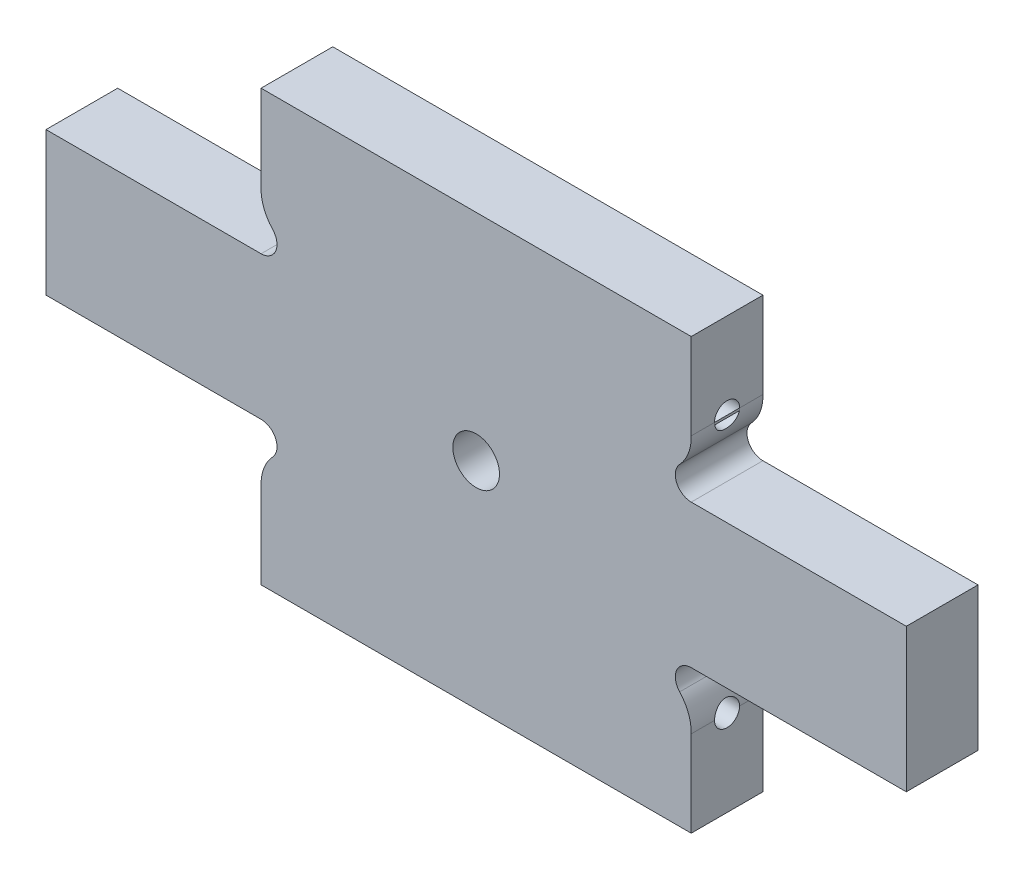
ISO-10303-21;
HEADER;
FILE_DESCRIPTION(('STEP AP214'),'2;1');
FILE_NAME('part.step','',(''),(''),'','','');
FILE_SCHEMA(('AUTOMOTIVE_DESIGN { 1 0 10303 214 1 1 1 1 }'));
ENDSEC;
DATA;
#1=APPLICATION_CONTEXT('core data for automotive mechanical design processes');
#2=APPLICATION_PROTOCOL_DEFINITION('international standard','automotive_design',2000,#1);
#3=PRODUCT_CONTEXT('',#1,'mechanical');
#4=PRODUCT('Part','Part','',(#3));
#5=PRODUCT_RELATED_PRODUCT_CATEGORY('part','',(#4));
#6=PRODUCT_DEFINITION_FORMATION('','',#4);
#7=PRODUCT_DEFINITION_CONTEXT('part definition',#1,'design');
#8=PRODUCT_DEFINITION('design','',#6,#7);
#9=PRODUCT_DEFINITION_SHAPE('','',#8);
#10=(LENGTH_UNIT() NAMED_UNIT(*) SI_UNIT(.MILLI.,.METRE.));
#11=(NAMED_UNIT(*) PLANE_ANGLE_UNIT() SI_UNIT($,.RADIAN.));
#12=(NAMED_UNIT(*) SI_UNIT($,.STERADIAN.) SOLID_ANGLE_UNIT());
#13=UNCERTAINTY_MEASURE_WITH_UNIT(LENGTH_MEASURE(1.E-05),#10,'distance_accuracy_value','');
#14=(GEOMETRIC_REPRESENTATION_CONTEXT(3) GLOBAL_UNCERTAINTY_ASSIGNED_CONTEXT((#13)) GLOBAL_UNIT_ASSIGNED_CONTEXT((#10,
#11,#12)) REPRESENTATION_CONTEXT('',''));
#15=CARTESIAN_POINT('',(0.,0.,0.));
#16=DIRECTION('',(0.,0.,1.));
#17=DIRECTION('',(1.,0.,0.));
#18=AXIS2_PLACEMENT_3D('',#15,#16,#17);
#19=CARTESIAN_POINT('',(24.0021116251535,17.8408301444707,10.));
#20=DIRECTION('',(0.,0.,-1.));
#21=DIRECTION('',(-1.,0.,0.));
#22=AXIS2_PLACEMENT_3D('',#19,#20,#21);
#23=CYLINDRICAL_SURFACE('',#22,6.00000000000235);
#24=CARTESIAN_POINT('',(30.,17.6816602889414,3.27919791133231));
#25=CARTESIAN_POINT('',(29.9987313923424,17.6337424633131,3.28806184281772));
#26=CARTESIAN_POINT('',(29.9968924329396,17.5862353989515,3.29892223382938));
#27=CARTESIAN_POINT('',(29.9921670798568,17.4923496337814,3.32454189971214));
#28=CARTESIAN_POINT('',(29.989280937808,17.4459706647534,3.33930023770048));
#29=CARTESIAN_POINT('',(29.9792095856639,17.3092146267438,3.38919308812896));
#30=CARTESIAN_POINT('',(29.9706030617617,17.2209391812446,3.42999758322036));
#31=CARTESIAN_POINT('',(29.9507233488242,17.0526542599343,3.52541371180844));
#32=CARTESIAN_POINT('',(29.9394511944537,16.9726415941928,3.58001998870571));
#33=CARTESIAN_POINT('',(29.9155983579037,16.8227748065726,3.70155930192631));
#34=CARTESIAN_POINT('',(29.9030172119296,16.7529243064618,3.76849671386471));
#35=CARTESIAN_POINT('',(29.8777467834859,16.6237217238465,3.91460477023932));
#36=CARTESIAN_POINT('',(29.8650614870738,16.5646427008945,3.99401777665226));
#37=CARTESIAN_POINT('',(29.8414450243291,16.4605977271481,4.16185492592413));
#38=CARTESIAN_POINT('',(29.8305138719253,16.4156318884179,4.2502791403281));
#39=CARTESIAN_POINT('',(29.8118198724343,16.3412405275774,4.43361922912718));
#40=CARTESIAN_POINT('',(29.8040524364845,16.3117924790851,4.52852546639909));
#41=CARTESIAN_POINT('',(29.7927035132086,16.2693540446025,4.72218092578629));
#42=CARTESIAN_POINT('',(29.7891208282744,16.256358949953,4.82092904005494));
#43=CARTESIAN_POINT('',(29.7866706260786,16.2474389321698,5.0160343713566));
#44=CARTESIAN_POINT('',(29.7876541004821,16.2509745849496,5.11236539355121));
#45=CARTESIAN_POINT('',(29.7938668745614,16.2737603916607,5.30300554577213));
#46=CARTESIAN_POINT('',(29.7990961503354,16.2930104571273,5.39731468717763));
#47=CARTESIAN_POINT('',(29.8130743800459,16.3463546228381,5.58050609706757));
#48=CARTESIAN_POINT('',(29.8217943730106,16.380326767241,5.6694262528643));
#49=CARTESIAN_POINT('',(29.8416979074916,16.4620650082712,5.84037847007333));
#50=CARTESIAN_POINT('',(29.852881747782,16.5098327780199,5.92240969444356));
#51=CARTESIAN_POINT('',(29.8767647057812,16.6194848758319,6.07988667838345));
#52=CARTESIAN_POINT('',(29.8894989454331,16.6817461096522,6.15506471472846));
#53=CARTESIAN_POINT('',(29.914681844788,16.8179421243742,6.2941067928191));
#54=CARTESIAN_POINT('',(29.9271303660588,16.8918824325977,6.3579654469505));
#55=CARTESIAN_POINT('',(29.9504593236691,17.0510508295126,6.47372665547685));
#56=CARTESIAN_POINT('',(29.9613048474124,17.1364692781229,6.52537458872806));
#57=CARTESIAN_POINT('',(29.9797000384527,17.3150510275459,6.61344855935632));
#58=CARTESIAN_POINT('',(29.9872558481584,17.4081995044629,6.64990295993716));
#59=CARTESIAN_POINT('',(29.9942830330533,17.5330112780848,6.68681922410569));
#60=CARTESIAN_POINT('',(29.9957265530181,17.5625013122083,6.69470639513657));
#61=CARTESIAN_POINT('',(29.9981864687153,17.6218268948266,6.70892101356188));
#62=CARTESIAN_POINT('',(29.9992034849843,17.6516618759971,6.7152507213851));
#63=CARTESIAN_POINT('',(30.,17.6816602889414,6.72080208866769));
#64=B_SPLINE_CURVE_WITH_KNOTS('',3,(#24,#25,#26,#27,#28,#29,#30,#31,#32,#33,#34,#35,#36,#37,#38,
#39,#40,#41,#42,#43,#44,#45,#46,#47,#48,#49,#50,#51,#52,#53,#54,#55,#56,#57,#58,#59,#60,#61,#62,
#63),.UNSPECIFIED.,.F.,.F.,(4,2,2,2,2,2,2,2,2,2,2,2,2,2,2,2,2,2,2,4),(0.,0.146146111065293,
0.292257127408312,0.583637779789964,0.874905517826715,1.16627680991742,1.4642356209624,
1.76219679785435,2.05972423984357,2.35716651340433,2.64497179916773,2.93277546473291,
3.21823925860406,3.50373768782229,3.79770983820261,4.09182153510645,4.39161125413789,
4.69083879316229,4.7824893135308,4.8740060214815),.UNSPECIFIED.);
#65=CARTESIAN_POINT('',(30.,17.6816602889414,3.27919791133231));
#66=VERTEX_POINT('',#65);
#67=CARTESIAN_POINT('',(30.,17.6816602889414,6.72080208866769));
#68=VERTEX_POINT('',#67);
#69=EDGE_CURVE('E498',#66,#68,#64,.T.);
#70=ORIENTED_EDGE('',*,*,#69,.T.);
#71=DIRECTION('',(0.,0.,-1.));
#72=VECTOR('',#71,1.);
#73=CARTESIAN_POINT('',(30.,17.6816602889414,10.));
#74=LINE('',#73,#72);
#75=EDGE_CURVE('E603',#68,#66,#74,.T.);
#76=ORIENTED_EDGE('',*,*,#75,.T.);
#77=EDGE_LOOP('',(#70,#76));
#78=FACE_BOUND('',#77,.T.);
#79=CARTESIAN_POINT('',(24.0021116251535,17.8408301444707,0.));
#80=DIRECTION('',(0.,0.,1.));
#81=DIRECTION('',(-1.,0.,0.));
#82=AXIS2_PLACEMENT_3D('',#79,#80,#81);
#83=CIRCLE('',#82,6.00000000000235);
#84=CARTESIAN_POINT('',(28.3795620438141,13.7374257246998,0.));
#85=VERTEX_POINT('',#84);
#86=CARTESIAN_POINT('',(30.,18.,0.));
#87=VERTEX_POINT('',#86);
#88=EDGE_CURVE('E274',#85,#87,#83,.T.);
#89=ORIENTED_EDGE('',*,*,#88,.T.);
#90=DIRECTION('',(0.,0.,-1.));
#91=VECTOR('',#90,1.);
#92=CARTESIAN_POINT('',(30.,18.,10.));
#93=LINE('',#92,#91);
#94=CARTESIAN_POINT('',(30.,18.,3.25000000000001));
#95=VERTEX_POINT('',#94);
#96=EDGE_CURVE('E482',#95,#87,#93,.T.);
#97=ORIENTED_EDGE('',*,*,#96,.F.);
#98=CARTESIAN_POINT('',(30.,18.,6.74999999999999));
#99=VERTEX_POINT('',#98);
#100=EDGE_CURVE('E488',#99,#95,#93,.T.);
#101=ORIENTED_EDGE('',*,*,#100,.F.);
#102=CARTESIAN_POINT('',(30.,18.,10.));
#103=VERTEX_POINT('',#102);
#104=EDGE_CURVE('E483',#103,#99,#93,.T.);
#105=ORIENTED_EDGE('',*,*,#104,.F.);
#106=CARTESIAN_POINT('',(24.0021116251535,17.8408301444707,10.));
#107=DIRECTION('',(0.,0.,1.));
#108=DIRECTION('',(-1.,0.,0.));
#109=AXIS2_PLACEMENT_3D('',#106,#107,#108);
#110=CIRCLE('',#109,6.00000000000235);
#111=CARTESIAN_POINT('',(28.3795620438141,13.7374257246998,10.));
#112=VERTEX_POINT('',#111);
#113=EDGE_CURVE('E278',#112,#103,#110,.T.);
#114=ORIENTED_EDGE('',*,*,#113,.F.);
#115=DIRECTION('',(0.,0.,-1.));
#116=VECTOR('',#115,1.);
#117=CARTESIAN_POINT('',(28.3795620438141,13.7374257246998,10.));
#118=LINE('',#117,#116);
#119=EDGE_CURVE('E340',#112,#85,#118,.T.);
#120=ORIENTED_EDGE('',*,*,#119,.T.);
#121=EDGE_LOOP('',(#89,#97,#101,#105,#114,#120));
#122=FACE_BOUND('',#121,.T.);
#123=ADVANCED_FACE('F45',(#78,#122),#23,.T.);
#124=CARTESIAN_POINT('',(30.,30.,10.));
#125=DIRECTION('',(-1.,0.,0.));
#126=DIRECTION('',(0.,-1.,0.));
#127=AXIS2_PLACEMENT_3D('',#124,#125,#126);
#128=PLANE('',#127);
#129=ORIENTED_EDGE('',*,*,#104,.T.);
#130=CARTESIAN_POINT('',(30.,18.,5.));
#131=DIRECTION('',(1.,0.,0.));
#132=DIRECTION('',(0.,0.,-1.));
#133=AXIS2_PLACEMENT_3D('',#130,#131,#132);
#134=CIRCLE('',#133,1.74999999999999);
#135=EDGE_CURVE('E252',#95,#99,#134,.T.);
#136=ORIENTED_EDGE('',*,*,#135,.F.);
#137=ORIENTED_EDGE('',*,*,#96,.T.);
#138=DIRECTION('',(0.,1.,0.));
#139=VECTOR('',#138,1.);
#140=CARTESIAN_POINT('',(30.,30.,0.));
#141=LINE('',#140,#139);
#142=CARTESIAN_POINT('',(30.,30.,0.));
#143=VERTEX_POINT('',#142);
#144=EDGE_CURVE('E344',#87,#143,#141,.T.);
#145=ORIENTED_EDGE('',*,*,#144,.T.);
#146=DIRECTION('',(0.,0.,-1.));
#147=VECTOR('',#146,1.);
#148=CARTESIAN_POINT('',(30.,30.,10.));
#149=LINE('',#148,#147);
#150=CARTESIAN_POINT('',(30.,30.,10.));
#151=VERTEX_POINT('',#150);
#152=EDGE_CURVE('E478',#151,#143,#149,.T.);
#153=ORIENTED_EDGE('',*,*,#152,.F.);
#154=DIRECTION('',(0.,1.,0.));
#155=VECTOR('',#154,1.);
#156=CARTESIAN_POINT('',(30.,30.,10.));
#157=LINE('',#156,#155);
#158=EDGE_CURVE('E282',#103,#151,#157,.T.);
#159=ORIENTED_EDGE('',*,*,#158,.F.);
#160=EDGE_LOOP('',(#129,#136,#137,#145,#153,#159));
#161=FACE_BOUND('',#160,.T.);
#162=ADVANCED_FACE('F558',(#161),#128,.F.);
#163=CARTESIAN_POINT('',(30.,30.,10.));
#164=DIRECTION('',(0.,-1.,0.));
#165=DIRECTION('',(1.,0.,0.));
#166=AXIS2_PLACEMENT_3D('',#163,#164,#165);
#167=PLANE('',#166);
#168=DIRECTION('',(-1.,0.,0.));
#169=VECTOR('',#168,1.);
#170=CARTESIAN_POINT('',(30.,30.,0.));
#171=LINE('',#170,#169);
#172=CARTESIAN_POINT('',(-30.,30.,0.));
#173=VERTEX_POINT('',#172);
#174=EDGE_CURVE('E347',#143,#173,#171,.T.);
#175=ORIENTED_EDGE('',*,*,#174,.T.);
#176=DIRECTION('',(0.,0.,-1.));
#177=VECTOR('',#176,1.);
#178=CARTESIAN_POINT('',(-30.,30.,10.));
#179=LINE('',#178,#177);
#180=CARTESIAN_POINT('',(-30.,30.,10.));
#181=VERTEX_POINT('',#180);
#182=EDGE_CURVE('E473',#181,#173,#179,.T.);
#183=ORIENTED_EDGE('',*,*,#182,.F.);
#184=DIRECTION('',(-1.,0.,0.));
#185=VECTOR('',#184,1.);
#186=CARTESIAN_POINT('',(30.,30.,10.));
#187=LINE('',#186,#185);
#188=EDGE_CURVE('E286',#151,#181,#187,.T.);
#189=ORIENTED_EDGE('',*,*,#188,.F.);
#190=ORIENTED_EDGE('',*,*,#152,.T.);
#191=EDGE_LOOP('',(#175,#183,#189,#190));
#192=FACE_BOUND('',#191,.T.);
#193=ADVANCED_FACE('F563',(#192),#167,.F.);
#194=CARTESIAN_POINT('',(-30.,30.,10.));
#195=DIRECTION('',(1.,0.,0.));
#196=DIRECTION('',(0.,1.,0.));
#197=AXIS2_PLACEMENT_3D('',#194,#195,#196);
#198=PLANE('',#197);
#199=DIRECTION('',(0.,0.,-1.));
#200=VECTOR('',#199,1.);
#201=CARTESIAN_POINT('',(-30.,18.,10.));
#202=LINE('',#201,#200);
#203=CARTESIAN_POINT('',(-30.,18.,3.25000000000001));
#204=VERTEX_POINT('',#203);
#205=CARTESIAN_POINT('',(-30.,18.,0.));
#206=VERTEX_POINT('',#205);
#207=EDGE_CURVE('E468',#204,#206,#202,.T.);
#208=ORIENTED_EDGE('',*,*,#207,.F.);
#209=CARTESIAN_POINT('',(-30.,18.,5.));
#210=DIRECTION('',(-1.,0.,0.));
#211=DIRECTION('',(0.,0.,1.));
#212=AXIS2_PLACEMENT_3D('',#209,#210,#211);
#213=CIRCLE('',#212,1.74999999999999);
#214=CARTESIAN_POINT('',(-30.,18.,6.74999999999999));
#215=VERTEX_POINT('',#214);
#216=EDGE_CURVE('E239',#215,#204,#213,.T.);
#217=ORIENTED_EDGE('',*,*,#216,.F.);
#218=CARTESIAN_POINT('',(-30.,18.,10.));
#219=VERTEX_POINT('',#218);
#220=EDGE_CURVE('E469',#219,#215,#202,.T.);
#221=ORIENTED_EDGE('',*,*,#220,.F.);
#222=DIRECTION('',(0.,-1.,0.));
#223=VECTOR('',#222,1.);
#224=CARTESIAN_POINT('',(-30.,30.,10.));
#225=LINE('',#224,#223);
#226=EDGE_CURVE('E289',#181,#219,#225,.T.);
#227=ORIENTED_EDGE('',*,*,#226,.F.);
#228=ORIENTED_EDGE('',*,*,#182,.T.);
#229=DIRECTION('',(0.,-1.,0.));
#230=VECTOR('',#229,1.);
#231=CARTESIAN_POINT('',(-30.,30.,0.));
#232=LINE('',#231,#230);
#233=EDGE_CURVE('E350',#173,#206,#232,.T.);
#234=ORIENTED_EDGE('',*,*,#233,.T.);
#235=EDGE_LOOP('',(#208,#217,#221,#227,#228,#234));
#236=FACE_BOUND('',#235,.T.);
#237=ADVANCED_FACE('F654',(#236),#198,.F.);
#238=CARTESIAN_POINT('',(-24.0021116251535,17.8408301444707,10.));
#239=DIRECTION('',(0.,0.,-1.));
#240=DIRECTION('',(-1.,0.,0.));
#241=AXIS2_PLACEMENT_3D('',#238,#239,#240);
#242=CYLINDRICAL_SURFACE('',#241,6.00000000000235);
#243=CARTESIAN_POINT('',(-30.,17.6816602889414,6.72080208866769));
#244=CARTESIAN_POINT('',(-29.9987313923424,17.6337424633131,6.71193815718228));
#245=CARTESIAN_POINT('',(-29.9968924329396,17.5862353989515,6.70107776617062));
#246=CARTESIAN_POINT('',(-29.9921670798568,17.4923496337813,6.67545810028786));
#247=CARTESIAN_POINT('',(-29.989280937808,17.4459706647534,6.66069976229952));
#248=CARTESIAN_POINT('',(-29.9792095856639,17.3092146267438,6.61080691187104));
#249=CARTESIAN_POINT('',(-29.9706030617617,17.2209391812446,6.57000241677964));
#250=CARTESIAN_POINT('',(-29.9507233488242,17.0526542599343,6.47458628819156));
#251=CARTESIAN_POINT('',(-29.9394511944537,16.9726415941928,6.41998001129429));
#252=CARTESIAN_POINT('',(-29.9155983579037,16.8227748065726,6.29844069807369));
#253=CARTESIAN_POINT('',(-29.9030172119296,16.7529243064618,6.23150328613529));
#254=CARTESIAN_POINT('',(-29.8777467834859,16.6237217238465,6.08539522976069));
#255=CARTESIAN_POINT('',(-29.8650614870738,16.5646427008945,6.00598222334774));
#256=CARTESIAN_POINT('',(-29.8414450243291,16.4605977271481,5.83814507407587));
#257=CARTESIAN_POINT('',(-29.8305138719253,16.4156318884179,5.7497208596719));
#258=CARTESIAN_POINT('',(-29.8118198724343,16.3412405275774,5.56638077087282));
#259=CARTESIAN_POINT('',(-29.8040524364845,16.3117924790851,5.47147453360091));
#260=CARTESIAN_POINT('',(-29.7927035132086,16.2693540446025,5.27781907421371));
#261=CARTESIAN_POINT('',(-29.7891208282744,16.256358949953,5.17907095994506));
#262=CARTESIAN_POINT('',(-29.7866706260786,16.2474389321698,4.9839656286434));
#263=CARTESIAN_POINT('',(-29.7876541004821,16.2509745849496,4.88763460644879));
#264=CARTESIAN_POINT('',(-29.7938668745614,16.2737603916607,4.69699445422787));
#265=CARTESIAN_POINT('',(-29.7990961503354,16.2930104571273,4.60268531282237));
#266=CARTESIAN_POINT('',(-29.8130743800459,16.3463546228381,4.41949390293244));
#267=CARTESIAN_POINT('',(-29.8217943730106,16.380326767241,4.33057374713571));
#268=CARTESIAN_POINT('',(-29.8416979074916,16.4620650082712,4.15962152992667));
#269=CARTESIAN_POINT('',(-29.852881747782,16.5098327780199,4.07759030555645));
#270=CARTESIAN_POINT('',(-29.8767647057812,16.6194848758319,3.92011332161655));
#271=CARTESIAN_POINT('',(-29.8894989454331,16.6817461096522,3.84493528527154));
#272=CARTESIAN_POINT('',(-29.914681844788,16.8179421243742,3.7058932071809));
#273=CARTESIAN_POINT('',(-29.9271303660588,16.8918824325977,3.64203455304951));
#274=CARTESIAN_POINT('',(-29.9504593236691,17.0510508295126,3.52627334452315));
#275=CARTESIAN_POINT('',(-29.9613048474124,17.1364692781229,3.47462541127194));
#276=CARTESIAN_POINT('',(-29.9797000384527,17.3150510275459,3.38655144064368));
#277=CARTESIAN_POINT('',(-29.9872558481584,17.4081995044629,3.35009704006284));
#278=CARTESIAN_POINT('',(-29.9942830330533,17.5330112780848,3.31318077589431));
#279=CARTESIAN_POINT('',(-29.9957265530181,17.5625013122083,3.30529360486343));
#280=CARTESIAN_POINT('',(-29.9981864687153,17.6218268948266,3.29107898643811));
#281=CARTESIAN_POINT('',(-29.9992034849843,17.6516618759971,3.2847492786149));
#282=CARTESIAN_POINT('',(-30.,17.6816602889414,3.27919791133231));
#283=B_SPLINE_CURVE_WITH_KNOTS('',3,(#243,#244,#245,#246,#247,#248,#249,#250,#251,#252,#253,
#254,#255,#256,#257,#258,#259,#260,#261,#262,#263,#264,#265,#266,#267,#268,#269,#270,#271,#272,
#273,#274,#275,#276,#277,#278,#279,#280,#281,#282),.UNSPECIFIED.,.F.,.F.,(4,2,2,2,2,2,2,2,2,2,2,
2,2,2,2,2,2,2,2,4),(0.,0.146146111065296,0.292257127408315,0.583637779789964,0.874905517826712,
1.16627680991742,1.4642356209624,1.76219679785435,2.05972423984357,2.35716651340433,
2.64497179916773,2.93277546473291,3.21823925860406,3.50373768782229,3.79770983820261,
4.09182153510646,4.39161125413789,4.69083879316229,4.7824893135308,4.87400602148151),.UNSPECIFIED.);
#284=CARTESIAN_POINT('',(-30.,17.6816602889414,6.72080208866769));
#285=VERTEX_POINT('',#284);
#286=CARTESIAN_POINT('',(-30.,17.6816602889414,3.27919791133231));
#287=VERTEX_POINT('',#286);
#288=EDGE_CURVE('E54',#285,#287,#283,.T.);
#289=ORIENTED_EDGE('',*,*,#288,.T.);
#290=DIRECTION('',(0.,0.,-1.));
#291=VECTOR('',#290,1.);
#292=CARTESIAN_POINT('',(-30.,17.6816602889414,10.));
#293=LINE('',#292,#291);
#294=EDGE_CURVE('E11',#287,#285,#293,.F.);
#295=ORIENTED_EDGE('',*,*,#294,.T.);
#296=EDGE_LOOP('',(#289,#295));
#297=FACE_BOUND('',#296,.T.);
#298=CARTESIAN_POINT('',(-24.0021116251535,17.8408301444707,0.));
#299=DIRECTION('',(0.,0.,1.));
#300=DIRECTION('',(1.,0.,0.));
#301=AXIS2_PLACEMENT_3D('',#298,#299,#300);
#302=CIRCLE('',#301,6.00000000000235);
#303=CARTESIAN_POINT('',(-28.3795620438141,13.7374257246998,0.));
#304=VERTEX_POINT('',#303);
#305=EDGE_CURVE('E354',#206,#304,#302,.T.);
#306=ORIENTED_EDGE('',*,*,#305,.T.);
#307=DIRECTION('',(0.,0.,-1.));
#308=VECTOR('',#307,1.);
#309=CARTESIAN_POINT('',(-28.3795620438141,13.7374257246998,10.));
#310=LINE('',#309,#308);
#311=CARTESIAN_POINT('',(-28.3795620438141,13.7374257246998,10.));
#312=VERTEX_POINT('',#311);
#313=EDGE_CURVE('E464',#312,#304,#310,.T.);
#314=ORIENTED_EDGE('',*,*,#313,.F.);
#315=CARTESIAN_POINT('',(-24.0021116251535,17.8408301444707,10.));
#316=DIRECTION('',(0.,0.,1.));
#317=DIRECTION('',(1.,0.,0.));
#318=AXIS2_PLACEMENT_3D('',#315,#316,#317);
#319=CIRCLE('',#318,6.00000000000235);
#320=EDGE_CURVE('E292',#219,#312,#319,.T.);
#321=ORIENTED_EDGE('',*,*,#320,.F.);
#322=ORIENTED_EDGE('',*,*,#220,.T.);
#323=EDGE_CURVE('E474',#215,#204,#202,.T.);
#324=ORIENTED_EDGE('',*,*,#323,.T.);
#325=ORIENTED_EDGE('',*,*,#207,.T.);
#326=EDGE_LOOP('',(#306,#314,#321,#322,#324,#325));
#327=FACE_BOUND('',#326,.T.);
#328=ADVANCED_FACE('F658',(#297,#327),#242,.T.);
#329=CARTESIAN_POINT('',(-30.000000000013,12.2199999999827,10.));
#330=DIRECTION('',(0.,0.,-1.));
#331=DIRECTION('',(-1.,0.,0.));
#332=AXIS2_PLACEMENT_3D('',#329,#330,#331);
#333=CYLINDRICAL_SURFACE('',#332,2.21999999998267);
#334=CARTESIAN_POINT('',(-30.000000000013,12.2199999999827,0.));
#335=DIRECTION('',(0.,0.,-1.));
#336=DIRECTION('',(1.,0.,0.));
#337=AXIS2_PLACEMENT_3D('',#334,#335,#336);
#338=CIRCLE('',#337,2.21999999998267);
#339=CARTESIAN_POINT('',(-30.000000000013,10.,0.));
#340=VERTEX_POINT('',#339);
#341=EDGE_CURVE('E357',#304,#340,#338,.T.);
#342=ORIENTED_EDGE('',*,*,#341,.T.);
#343=DIRECTION('',(0.,0.,-1.));
#344=VECTOR('',#343,1.);
#345=CARTESIAN_POINT('',(-30.000000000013,10.,10.));
#346=LINE('',#345,#344);
#347=CARTESIAN_POINT('',(-30.000000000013,10.,10.));
#348=VERTEX_POINT('',#347);
#349=EDGE_CURVE('E460',#348,#340,#346,.T.);
#350=ORIENTED_EDGE('',*,*,#349,.F.);
#351=CARTESIAN_POINT('',(-30.000000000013,12.2199999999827,10.));
#352=DIRECTION('',(0.,0.,-1.));
#353=DIRECTION('',(1.,0.,0.));
#354=AXIS2_PLACEMENT_3D('',#351,#352,#353);
#355=CIRCLE('',#354,2.21999999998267);
#356=EDGE_CURVE('E295',#312,#348,#355,.T.);
#357=ORIENTED_EDGE('',*,*,#356,.F.);
#358=ORIENTED_EDGE('',*,*,#313,.T.);
#359=EDGE_LOOP('',(#342,#350,#357,#358));
#360=FACE_BOUND('',#359,.T.);
#361=ADVANCED_FACE('F668',(#360),#333,.F.);
#362=CARTESIAN_POINT('',(-30.000000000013,10.,10.));
#363=DIRECTION('',(0.,-1.,0.));
#364=DIRECTION('',(0.,0.,-1.));
#365=AXIS2_PLACEMENT_3D('',#362,#363,#364);
#366=PLANE('',#365);
#367=DIRECTION('',(-1.,0.,0.));
#368=VECTOR('',#367,1.);
#369=CARTESIAN_POINT('',(-30.000000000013,10.,0.));
#370=LINE('',#369,#368);
#371=CARTESIAN_POINT('',(-60.,10.,0.));
#372=VERTEX_POINT('',#371);
#373=EDGE_CURVE('E360',#340,#372,#370,.T.);
#374=ORIENTED_EDGE('',*,*,#373,.T.);
#375=DIRECTION('',(0.,0.,-1.));
#376=VECTOR('',#375,1.);
#377=CARTESIAN_POINT('',(-60.,10.,10.));
#378=LINE('',#377,#376);
#379=CARTESIAN_POINT('',(-60.,10.,10.));
#380=VERTEX_POINT('',#379);
#381=EDGE_CURVE('E456',#380,#372,#378,.T.);
#382=ORIENTED_EDGE('',*,*,#381,.F.);
#383=DIRECTION('',(-1.,0.,0.));
#384=VECTOR('',#383,1.);
#385=CARTESIAN_POINT('',(-30.000000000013,10.,10.));
#386=LINE('',#385,#384);
#387=EDGE_CURVE('E298',#348,#380,#386,.T.);
#388=ORIENTED_EDGE('',*,*,#387,.F.);
#389=ORIENTED_EDGE('',*,*,#349,.T.);
#390=EDGE_LOOP('',(#374,#382,#388,#389));
#391=FACE_BOUND('',#390,.T.);
#392=ADVANCED_FACE('F824',(#391),#366,.F.);
#393=CARTESIAN_POINT('',(-60.,10.,10.));
#394=DIRECTION('',(1.,0.,0.));
#395=DIRECTION('',(0.,0.,-1.));
#396=AXIS2_PLACEMENT_3D('',#393,#394,#395);
#397=PLANE('',#396);
#398=DIRECTION('',(0.,-1.,0.));
#399=VECTOR('',#398,1.);
#400=CARTESIAN_POINT('',(-60.,10.,0.));
#401=LINE('',#400,#399);
#402=CARTESIAN_POINT('',(-60.,-10.,0.));
#403=VERTEX_POINT('',#402);
#404=EDGE_CURVE('E363',#372,#403,#401,.T.);
#405=ORIENTED_EDGE('',*,*,#404,.T.);
#406=DIRECTION('',(0.,0.,-1.));
#407=VECTOR('',#406,1.);
#408=CARTESIAN_POINT('',(-60.,-10.,10.));
#409=LINE('',#408,#407);
#410=CARTESIAN_POINT('',(-60.,-10.,10.));
#411=VERTEX_POINT('',#410);
#412=EDGE_CURVE('E452',#411,#403,#409,.T.);
#413=ORIENTED_EDGE('',*,*,#412,.F.);
#414=DIRECTION('',(0.,-1.,0.));
#415=VECTOR('',#414,1.);
#416=CARTESIAN_POINT('',(-60.,10.,10.));
#417=LINE('',#416,#415);
#418=EDGE_CURVE('E301',#380,#411,#417,.T.);
#419=ORIENTED_EDGE('',*,*,#418,.F.);
#420=ORIENTED_EDGE('',*,*,#381,.T.);
#421=EDGE_LOOP('',(#405,#413,#419,#420));
#422=FACE_BOUND('',#421,.T.);
#423=ADVANCED_FACE('F815',(#422),#397,.F.);
#424=CARTESIAN_POINT('',(-60.,-10.,10.));
#425=DIRECTION('',(0.,1.,0.));
#426=DIRECTION('',(-1.,0.,0.));
#427=AXIS2_PLACEMENT_3D('',#424,#425,#426);
#428=PLANE('',#427);
#429=DIRECTION('',(1.,0.,0.));
#430=VECTOR('',#429,1.);
#431=CARTESIAN_POINT('',(-60.,-10.,0.));
#432=LINE('',#431,#430);
#433=CARTESIAN_POINT('',(-30.000000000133,-9.99999999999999,0.));
#434=VERTEX_POINT('',#433);
#435=EDGE_CURVE('E366',#403,#434,#432,.T.);
#436=ORIENTED_EDGE('',*,*,#435,.T.);
#437=DIRECTION('',(0.,0.,-1.));
#438=VECTOR('',#437,1.);
#439=CARTESIAN_POINT('',(-30.000000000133,-9.99999999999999,10.));
#440=LINE('',#439,#438);
#441=CARTESIAN_POINT('',(-30.000000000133,-9.99999999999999,10.));
#442=VERTEX_POINT('',#441);
#443=EDGE_CURVE('E448',#442,#434,#440,.T.);
#444=ORIENTED_EDGE('',*,*,#443,.F.);
#445=DIRECTION('',(1.,0.,0.));
#446=VECTOR('',#445,1.);
#447=CARTESIAN_POINT('',(-60.,-10.,10.));
#448=LINE('',#447,#446);
#449=EDGE_CURVE('E304',#411,#442,#448,.T.);
#450=ORIENTED_EDGE('',*,*,#449,.F.);
#451=ORIENTED_EDGE('',*,*,#412,.T.);
#452=EDGE_LOOP('',(#436,#444,#450,#451));
#453=FACE_BOUND('',#452,.T.);
#454=ADVANCED_FACE('F807',(#453),#428,.F.);
#455=CARTESIAN_POINT('',(-30.000000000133,-12.2200000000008,10.));
#456=DIRECTION('',(0.,0.,-1.));
#457=DIRECTION('',(-1.,0.,0.));
#458=AXIS2_PLACEMENT_3D('',#455,#456,#457);
#459=CYLINDRICAL_SURFACE('',#458,2.22000000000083);
#460=CARTESIAN_POINT('',(-30.000000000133,-12.2200000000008,0.));
#461=DIRECTION('',(0.,0.,-1.));
#462=DIRECTION('',(1.,0.,0.));
#463=AXIS2_PLACEMENT_3D('',#460,#461,#462);
#464=CIRCLE('',#463,2.22000000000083);
#465=CARTESIAN_POINT('',(-28.3795620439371,-13.7374257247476,0.));
#466=VERTEX_POINT('',#465);
#467=EDGE_CURVE('E369',#434,#466,#464,.T.);
#468=ORIENTED_EDGE('',*,*,#467,.T.);
#469=DIRECTION('',(0.,0.,-1.));
#470=VECTOR('',#469,1.);
#471=CARTESIAN_POINT('',(-28.3795620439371,-13.7374257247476,10.));
#472=LINE('',#471,#470);
#473=CARTESIAN_POINT('',(-28.3795620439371,-13.7374257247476,10.));
#474=VERTEX_POINT('',#473);
#475=EDGE_CURVE('E444',#474,#466,#472,.T.);
#476=ORIENTED_EDGE('',*,*,#475,.F.);
#477=CARTESIAN_POINT('',(-30.000000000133,-12.2200000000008,10.));
#478=DIRECTION('',(0.,0.,-1.));
#479=DIRECTION('',(1.,0.,0.));
#480=AXIS2_PLACEMENT_3D('',#477,#478,#479);
#481=CIRCLE('',#480,2.22000000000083);
#482=EDGE_CURVE('E307',#442,#474,#481,.T.);
#483=ORIENTED_EDGE('',*,*,#482,.F.);
#484=ORIENTED_EDGE('',*,*,#443,.T.);
#485=EDGE_LOOP('',(#468,#476,#483,#484));
#486=FACE_BOUND('',#485,.T.);
#487=ADVANCED_FACE('F678',(#486),#459,.F.);
#488=CARTESIAN_POINT('',(-24.0000000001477,-17.8385763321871,10.));
#489=DIRECTION('',(0.,0.,-1.));
#490=DIRECTION('',(-1.,0.,0.));
#491=AXIS2_PLACEMENT_3D('',#488,#489,#490);
#492=CYLINDRICAL_SURFACE('',#491,6.00000000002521);
#493=DIRECTION('',(0.,0.,-1.));
#494=VECTOR('',#493,1.);
#495=CARTESIAN_POINT('',(-29.9978281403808,-18.,10.));
#496=LINE('',#495,#494);
#497=CARTESIAN_POINT('',(-29.9978281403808,-18.,3.25000000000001));
#498=VERTEX_POINT('',#497);
#499=CARTESIAN_POINT('',(-29.9978281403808,-18.,0.));
#500=VERTEX_POINT('',#499);
#501=EDGE_CURVE('E439',#498,#500,#496,.T.);
#502=ORIENTED_EDGE('',*,*,#501,.F.);
#503=CARTESIAN_POINT('',(-29.9978281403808,-18.,3.25000000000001));
#504=CARTESIAN_POINT('',(-29.9991213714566,-17.9520643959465,3.2499992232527));
#505=CARTESIAN_POINT('',(-29.9998323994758,-17.9041364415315,3.25197087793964));
#506=CARTESIAN_POINT('',(-30.000114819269,-17.8086077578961,3.25983702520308));
#507=CARTESIAN_POINT('',(-29.9996863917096,-17.7610069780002,3.26573089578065));
#508=CARTESIAN_POINT('',(-29.9967354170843,-17.6194289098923,3.28921586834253));
#509=CARTESIAN_POINT('',(-29.9925547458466,-17.5263796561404,3.31261066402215));
#510=CARTESIAN_POINT('',(-29.9804039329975,-17.3456267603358,3.37413859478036));
#511=CARTESIAN_POINT('',(-29.9724339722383,-17.2579228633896,3.41227102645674));
#512=CARTESIAN_POINT('',(-29.9537286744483,-17.0900779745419,3.50213360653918));
#513=CARTESIAN_POINT('',(-29.9429925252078,-17.0099392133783,3.55386774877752));
#514=CARTESIAN_POINT('',(-29.9197837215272,-16.8576436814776,3.67074012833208));
#515=CARTESIAN_POINT('',(-29.9072790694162,-16.7856922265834,3.73613935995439));
#516=CARTESIAN_POINT('',(-29.8822022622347,-16.6535752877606,3.87793332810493));
#517=CARTESIAN_POINT('',(-29.8696300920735,-16.5934125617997,3.95433063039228));
#518=CARTESIAN_POINT('',(-29.8456500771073,-16.4852381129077,4.11804831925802));
#519=CARTESIAN_POINT('',(-29.8342754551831,-16.4375359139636,4.20557863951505));
#520=CARTESIAN_POINT('',(-29.8144966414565,-16.3575847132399,4.38774150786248));
#521=CARTESIAN_POINT('',(-29.8060918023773,-16.3253323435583,4.48237250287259));
#522=CARTESIAN_POINT('',(-29.7935011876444,-16.2778257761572,4.67414129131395));
#523=CARTESIAN_POINT('',(-29.7892371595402,-16.2622557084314,4.77119552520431));
#524=CARTESIAN_POINT('',(-29.7852212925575,-16.2475776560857,4.96662732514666));
#525=CARTESIAN_POINT('',(-29.7854686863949,-16.2484668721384,5.0650046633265));
#526=CARTESIAN_POINT('',(-29.7903669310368,-16.266403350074,5.25729660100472));
#527=CARTESIAN_POINT('',(-29.7948912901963,-16.2829864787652,5.35125827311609));
#528=CARTESIAN_POINT('',(-29.8075880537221,-16.3310838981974,5.53501515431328));
#529=CARTESIAN_POINT('',(-29.8157607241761,-16.3625992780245,5.6248100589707));
#530=CARTESIAN_POINT('',(-29.8348616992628,-16.4400104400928,5.79881083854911));
#531=CARTESIAN_POINT('',(-29.8458186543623,-16.48605702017,5.88294633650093));
#532=CARTESIAN_POINT('',(-29.8691380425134,-16.5911361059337,6.04246270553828));
#533=CARTESIAN_POINT('',(-29.8815007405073,-16.6501710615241,6.11784192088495));
#534=CARTESIAN_POINT('',(-29.9065961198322,-16.7818142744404,6.26024764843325));
#535=CARTESIAN_POINT('',(-29.919327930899,-16.8547975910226,6.32692811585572));
#536=CARTESIAN_POINT('',(-29.943195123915,-17.0111270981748,6.44718842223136));
#537=CARTESIAN_POINT('',(-29.9543301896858,-17.0944753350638,6.50076566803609));
#538=CARTESIAN_POINT('',(-29.973589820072,-17.2693897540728,6.59327094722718));
#539=CARTESIAN_POINT('',(-29.9817108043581,-17.3609655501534,6.63218155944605));
#540=CARTESIAN_POINT('',(-29.9937773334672,-17.5495816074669,6.69394119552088));
#541=CARTESIAN_POINT('',(-29.997728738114,-17.6466139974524,6.71681274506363));
#542=CARTESIAN_POINT('',(-29.9999295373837,-17.7870780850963,6.7375270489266));
#543=CARTESIAN_POINT('',(-30.0001445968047,-17.8295681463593,6.74220582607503));
#544=CARTESIAN_POINT('',(-29.9996677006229,-17.914702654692,6.74843918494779));
#545=CARTESIAN_POINT('',(-29.9989772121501,-17.9573467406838,6.74999880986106));
#546=CARTESIAN_POINT('',(-29.9978281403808,-18.,6.75000000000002));
#547=B_SPLINE_CURVE_WITH_KNOTS('',3,(#503,#504,#505,#506,#507,#508,#509,#510,#511,#512,#513,
#514,#515,#516,#517,#518,#519,#520,#521,#522,#523,#524,#525,#526,#527,#528,#529,#530,#531,#532,
#533,#534,#535,#536,#537,#538,#539,#540,#541,#542,#543,#544,#545,#546),.UNSPECIFIED.,.F.,.F.,(4,
2,2,2,2,2,2,2,2,2,2,2,2,2,2,2,2,2,2,2,2,4),(0.,0.143768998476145,0.28751520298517,
0.574130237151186,0.860731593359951,1.14741719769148,1.44018255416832,1.73301632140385,
2.03255040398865,2.33201916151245,2.62571161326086,2.91935411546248,3.20457514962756,
3.48981698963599,3.77812206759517,4.06648157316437,4.36410291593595,4.66178311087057,
4.95981578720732,5.25742905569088,5.38556886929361,5.51350133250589),.UNSPECIFIED.);
#548=CARTESIAN_POINT('',(-29.9978281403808,-18.,6.74999999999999));
#549=VERTEX_POINT('',#548);
#550=EDGE_CURVE('E605',#498,#549,#547,.T.);
#551=ORIENTED_EDGE('',*,*,#550,.T.);
#552=CARTESIAN_POINT('',(-29.9978281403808,-18.,10.));
#553=VERTEX_POINT('',#552);
#554=EDGE_CURVE('E440',#553,#549,#496,.T.);
#555=ORIENTED_EDGE('',*,*,#554,.F.);
#556=CARTESIAN_POINT('',(-24.0000000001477,-17.8385763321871,10.));
#557=DIRECTION('',(0.,0.,1.));
#558=DIRECTION('',(1.,0.,0.));
#559=AXIS2_PLACEMENT_3D('',#556,#557,#558);
#560=CIRCLE('',#559,6.00000000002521);
#561=EDGE_CURVE('E310',#474,#553,#560,.T.);
#562=ORIENTED_EDGE('',*,*,#561,.F.);
#563=ORIENTED_EDGE('',*,*,#475,.T.);
#564=CARTESIAN_POINT('',(-24.0000000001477,-17.8385763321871,0.));
#565=DIRECTION('',(0.,0.,1.));
#566=DIRECTION('',(1.,0.,0.));
#567=AXIS2_PLACEMENT_3D('',#564,#565,#566);
#568=CIRCLE('',#567,6.00000000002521);
#569=EDGE_CURVE('E372',#466,#500,#568,.T.);
#570=ORIENTED_EDGE('',*,*,#569,.T.);
#571=EDGE_LOOP('',(#502,#551,#555,#562,#563,#570));
#572=FACE_BOUND('',#571,.T.);
#573=ADVANCED_FACE('F622',(#572),#492,.T.);
#574=CARTESIAN_POINT('',(-29.9978281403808,-18.,10.));
#575=DIRECTION('',(1.,0.,0.));
#576=DIRECTION('',(0.,0.,-1.));
#577=AXIS2_PLACEMENT_3D('',#574,#575,#576);
#578=PLANE('',#577);
#579=ORIENTED_EDGE('',*,*,#554,.T.);
#580=CARTESIAN_POINT('',(-29.9978281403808,-18.,5.));
#581=DIRECTION('',(1.,0.,0.));
#582=DIRECTION('',(0.,0.,-1.));
#583=AXIS2_PLACEMENT_3D('',#580,#581,#582);
#584=CIRCLE('',#583,1.74999999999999);
#585=EDGE_CURVE('E244',#549,#498,#584,.T.);
#586=ORIENTED_EDGE('',*,*,#585,.T.);
#587=ORIENTED_EDGE('',*,*,#501,.T.);
#588=DIRECTION('',(0.,-1.,0.));
#589=VECTOR('',#588,1.);
#590=CARTESIAN_POINT('',(-29.9978281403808,-18.,0.));
#591=LINE('',#590,#589);
#592=CARTESIAN_POINT('',(-29.9978281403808,-30.,0.));
#593=VERTEX_POINT('',#592);
#594=EDGE_CURVE('E376',#500,#593,#591,.T.);
#595=ORIENTED_EDGE('',*,*,#594,.T.);
#596=DIRECTION('',(0.,0.,-1.));
#597=VECTOR('',#596,1.);
#598=CARTESIAN_POINT('',(-29.9978281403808,-30.,10.));
#599=LINE('',#598,#597);
#600=CARTESIAN_POINT('',(-29.9978281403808,-30.,10.));
#601=VERTEX_POINT('',#600);
#602=EDGE_CURVE('E435',#601,#593,#599,.T.);
#603=ORIENTED_EDGE('',*,*,#602,.F.);
#604=DIRECTION('',(0.,-1.,0.));
#605=VECTOR('',#604,1.);
#606=CARTESIAN_POINT('',(-29.9978281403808,-18.,10.));
#607=LINE('',#606,#605);
#608=EDGE_CURVE('E313',#553,#601,#607,.T.);
#609=ORIENTED_EDGE('',*,*,#608,.F.);
#610=EDGE_LOOP('',(#579,#586,#587,#595,#603,#609));
#611=FACE_BOUND('',#610,.T.);
#612=ADVANCED_FACE('F677',(#611),#578,.F.);
#613=CARTESIAN_POINT('',(-29.9978281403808,-30.,10.));
#614=DIRECTION('',(0.,1.,0.));
#615=DIRECTION('',(-1.,0.,0.));
#616=AXIS2_PLACEMENT_3D('',#613,#614,#615);
#617=PLANE('',#616);
#618=DIRECTION('',(1.,0.,0.));
#619=VECTOR('',#618,1.);
#620=CARTESIAN_POINT('',(-29.9978281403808,-30.,0.));
#621=LINE('',#620,#619);
#622=CARTESIAN_POINT('',(29.9978281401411,-30.,0.));
#623=VERTEX_POINT('',#622);
#624=EDGE_CURVE('E379',#593,#623,#621,.T.);
#625=ORIENTED_EDGE('',*,*,#624,.T.);
#626=DIRECTION('',(0.,0.,-1.));
#627=VECTOR('',#626,1.);
#628=CARTESIAN_POINT('',(29.9978281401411,-30.,10.));
#629=LINE('',#628,#627);
#630=CARTESIAN_POINT('',(29.9978281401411,-30.,10.));
#631=VERTEX_POINT('',#630);
#632=EDGE_CURVE('E431',#631,#623,#629,.T.);
#633=ORIENTED_EDGE('',*,*,#632,.F.);
#634=DIRECTION('',(1.,0.,0.));
#635=VECTOR('',#634,1.);
#636=CARTESIAN_POINT('',(-29.9978281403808,-30.,10.));
#637=LINE('',#636,#635);
#638=EDGE_CURVE('E316',#601,#631,#637,.T.);
#639=ORIENTED_EDGE('',*,*,#638,.F.);
#640=ORIENTED_EDGE('',*,*,#602,.T.);
#641=EDGE_LOOP('',(#625,#633,#639,#640));
#642=FACE_BOUND('',#641,.T.);
#643=ADVANCED_FACE('F686',(#642),#617,.F.);
#644=CARTESIAN_POINT('',(29.9978281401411,-30.,10.));
#645=DIRECTION('',(-1.,0.,0.));
#646=DIRECTION('',(0.,0.,1.));
#647=AXIS2_PLACEMENT_3D('',#644,#645,#646);
#648=PLANE('',#647);
#649=DIRECTION('',(0.,0.,-1.));
#650=VECTOR('',#649,1.);
#651=CARTESIAN_POINT('',(29.9978281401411,-18.,10.));
#652=LINE('',#651,#650);
#653=CARTESIAN_POINT('',(29.9978281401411,-18.,3.25000000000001));
#654=VERTEX_POINT('',#653);
#655=CARTESIAN_POINT('',(29.9978281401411,-18.,0.));
#656=VERTEX_POINT('',#655);
#657=EDGE_CURVE('E426',#654,#656,#652,.T.);
#658=ORIENTED_EDGE('',*,*,#657,.F.);
#659=CARTESIAN_POINT('',(29.9978281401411,-18.,5.));
#660=DIRECTION('',(-1.,0.,0.));
#661=DIRECTION('',(0.,0.,1.));
#662=AXIS2_PLACEMENT_3D('',#659,#660,#661);
#663=CIRCLE('',#662,1.74999999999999);
#664=CARTESIAN_POINT('',(29.9978281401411,-18.,6.74999999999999));
#665=VERTEX_POINT('',#664);
#666=EDGE_CURVE('E265',#654,#665,#663,.T.);
#667=ORIENTED_EDGE('',*,*,#666,.T.);
#668=CARTESIAN_POINT('',(29.9978281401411,-18.,10.));
#669=VERTEX_POINT('',#668);
#670=EDGE_CURVE('E427',#669,#665,#652,.T.);
#671=ORIENTED_EDGE('',*,*,#670,.F.);
#672=DIRECTION('',(0.,1.,0.));
#673=VECTOR('',#672,1.);
#674=CARTESIAN_POINT('',(29.9978281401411,-30.,10.));
#675=LINE('',#674,#673);
#676=EDGE_CURVE('E319',#631,#669,#675,.T.);
#677=ORIENTED_EDGE('',*,*,#676,.F.);
#678=ORIENTED_EDGE('',*,*,#632,.T.);
#679=DIRECTION('',(0.,1.,0.));
#680=VECTOR('',#679,1.);
#681=CARTESIAN_POINT('',(29.9978281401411,-30.,0.));
#682=LINE('',#681,#680);
#683=EDGE_CURVE('E382',#623,#656,#682,.T.);
#684=ORIENTED_EDGE('',*,*,#683,.T.);
#685=EDGE_LOOP('',(#658,#667,#671,#677,#678,#684));
#686=FACE_BOUND('',#685,.T.);
#687=ADVANCED_FACE('F555',(#686),#648,.F.);
#688=CARTESIAN_POINT('',(23.9999999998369,-17.8385763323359,10.));
#689=DIRECTION('',(0.,0.,-1.));
#690=DIRECTION('',(-1.,0.,0.));
#691=AXIS2_PLACEMENT_3D('',#688,#689,#690);
#692=CYLINDRICAL_SURFACE('',#691,6.00000000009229);
#693=ORIENTED_EDGE('',*,*,#670,.T.);
#694=CARTESIAN_POINT('',(29.9978281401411,-18.,6.74999999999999));
#695=CARTESIAN_POINT('',(29.9991213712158,-17.9520643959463,6.7500007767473));
#696=CARTESIAN_POINT('',(29.9998323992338,-17.9041364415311,6.74802912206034));
#697=CARTESIAN_POINT('',(30.0001148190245,-17.8086077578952,6.74016297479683));
#698=CARTESIAN_POINT('',(29.999686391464,-17.7610069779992,6.73426910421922));
#699=CARTESIAN_POINT('',(29.9967354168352,-17.6194289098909,6.71078413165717));
#700=CARTESIAN_POINT('',(29.9925547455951,-17.5263796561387,6.68738933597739));
#701=CARTESIAN_POINT('',(29.9804039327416,-17.3456267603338,6.62586140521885));
#702=CARTESIAN_POINT('',(29.9724339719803,-17.2579228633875,6.58772897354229));
#703=CARTESIAN_POINT('',(29.9537286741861,-17.0900779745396,6.49786639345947));
#704=CARTESIAN_POINT('',(29.9429925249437,-17.0099392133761,6.44613225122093));
#705=CARTESIAN_POINT('',(29.9197837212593,-16.8576436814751,6.32925987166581));
#706=CARTESIAN_POINT('',(29.9072790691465,-16.7856922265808,6.2638606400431));
#707=CARTESIAN_POINT('',(29.8822022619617,-16.6535752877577,6.12206667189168));
#708=CARTESIAN_POINT('',(29.8696300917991,-16.5934125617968,6.04566936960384));
#709=CARTESIAN_POINT('',(29.8456500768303,-16.4852381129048,5.88195168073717));
#710=CARTESIAN_POINT('',(29.8342754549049,-16.4375359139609,5.79442136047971));
#711=CARTESIAN_POINT('',(29.8144966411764,-16.3575847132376,5.61225849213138));
#712=CARTESIAN_POINT('',(29.8060918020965,-16.3253323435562,5.5176274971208));
#713=CARTESIAN_POINT('',(29.7935011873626,-16.2778257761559,5.32585870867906));
#714=CARTESIAN_POINT('',(29.7892371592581,-16.2622557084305,5.22880447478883));
#715=CARTESIAN_POINT('',(29.7852212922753,-16.2475776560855,5.03337267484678));
#716=CARTESIAN_POINT('',(29.7854686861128,-16.2484668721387,4.93499533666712));
#717=CARTESIAN_POINT('',(29.7903669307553,-16.2664033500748,4.74270339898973));
#718=CARTESIAN_POINT('',(29.7948912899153,-16.2829864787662,4.64874172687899));
#719=CARTESIAN_POINT('',(29.8075880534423,-16.3310838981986,4.4649848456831));
#720=CARTESIAN_POINT('',(29.815760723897,-16.3625992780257,4.37518994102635));
#721=CARTESIAN_POINT('',(29.8348616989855,-16.4400104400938,4.20118916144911));
#722=CARTESIAN_POINT('',(29.8458186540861,-16.4860570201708,4.1170536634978));
#723=CARTESIAN_POINT('',(29.8691380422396,-16.5911361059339,3.95753729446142));
#724=CARTESIAN_POINT('',(29.8815007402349,-16.6501710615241,3.88215807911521));
#725=CARTESIAN_POINT('',(29.9065961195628,-16.7818142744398,3.73975235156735));
#726=CARTESIAN_POINT('',(29.9193279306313,-16.8547975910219,3.67307188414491));
#727=CARTESIAN_POINT('',(29.943195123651,-17.0111270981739,3.55281157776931));
#728=CARTESIAN_POINT('',(29.9543301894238,-17.0944753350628,3.49923433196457));
#729=CARTESIAN_POINT('',(29.9735898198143,-17.2693897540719,3.40672905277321));
#730=CARTESIAN_POINT('',(29.9817108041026,-17.3609655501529,3.36781844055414));
#731=CARTESIAN_POINT('',(29.9937773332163,-17.5495816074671,3.30605880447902));
#732=CARTESIAN_POINT('',(29.9977287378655,-17.6466139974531,3.28318725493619));
#733=CARTESIAN_POINT('',(29.9999295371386,-17.7870780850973,3.26247295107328));
#734=CARTESIAN_POINT('',(30.0001445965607,-17.8295681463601,3.2577941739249));
#735=CARTESIAN_POINT('',(29.9996677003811,-17.9147026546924,3.2515608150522));
#736=CARTESIAN_POINT('',(29.9989772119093,-17.957346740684,3.25000119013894));
#737=CARTESIAN_POINT('',(29.9978281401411,-18.,3.24999999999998));
#738=B_SPLINE_CURVE_WITH_KNOTS('',3,(#694,#695,#696,#697,#698,#699,#700,#701,#702,#703,#704,
#705,#706,#707,#708,#709,#710,#711,#712,#713,#714,#715,#716,#717,#718,#719,#720,#721,#722,#723,
#724,#725,#726,#727,#728,#729,#730,#731,#732,#733,#734,#735,#736,#737),.UNSPECIFIED.,.F.,.F.,(4,
2,2,2,2,2,2,2,2,2,2,2,2,2,2,2,2,2,2,2,2,4),(0.,0.143768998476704,0.287515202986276,
0.574130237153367,0.860731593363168,1.14741719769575,1.44018255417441,1.73301632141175,
2.03255040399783,2.3320191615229,2.62571161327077,2.91935411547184,3.20457514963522,
3.48981698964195,3.77812206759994,4.06648157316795,4.3641029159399,4.66178311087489,
4.95981578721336,5.25742905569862,5.38556886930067,5.51350133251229),.UNSPECIFIED.);
#739=EDGE_CURVE('E487',#665,#654,#738,.T.);
#740=ORIENTED_EDGE('',*,*,#739,.T.);
#741=ORIENTED_EDGE('',*,*,#657,.T.);
#742=CARTESIAN_POINT('',(23.9999999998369,-17.8385763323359,0.));
#743=DIRECTION('',(0.,0.,1.));
#744=DIRECTION('',(1.,0.,0.));
#745=AXIS2_PLACEMENT_3D('',#742,#743,#744);
#746=CIRCLE('',#745,6.00000000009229);
#747=CARTESIAN_POINT('',(28.3795620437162,-13.7374257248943,0.));
#748=VERTEX_POINT('',#747);
#749=EDGE_CURVE('E386',#656,#748,#746,.T.);
#750=ORIENTED_EDGE('',*,*,#749,.T.);
#751=DIRECTION('',(0.,0.,-1.));
#752=VECTOR('',#751,1.);
#753=CARTESIAN_POINT('',(28.3795620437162,-13.7374257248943,10.));
#754=LINE('',#753,#752);
#755=CARTESIAN_POINT('',(28.3795620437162,-13.7374257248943,10.));
#756=VERTEX_POINT('',#755);
#757=EDGE_CURVE('E422',#756,#748,#754,.T.);
#758=ORIENTED_EDGE('',*,*,#757,.F.);
#759=CARTESIAN_POINT('',(23.9999999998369,-17.8385763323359,10.));
#760=DIRECTION('',(0.,0.,1.));
#761=DIRECTION('',(1.,0.,0.));
#762=AXIS2_PLACEMENT_3D('',#759,#760,#761);
#763=CIRCLE('',#762,6.00000000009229);
#764=EDGE_CURVE('E322',#669,#756,#763,.T.);
#765=ORIENTED_EDGE('',*,*,#764,.F.);
#766=EDGE_LOOP('',(#693,#740,#741,#750,#758,#765));
#767=FACE_BOUND('',#766,.T.);
#768=ADVANCED_FACE('F505',(#767),#692,.T.);
#769=CARTESIAN_POINT('',(29.9999999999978,-12.2200000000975,10.));
#770=DIRECTION('',(0.,0.,-1.));
#771=DIRECTION('',(-1.,0.,0.));
#772=AXIS2_PLACEMENT_3D('',#769,#770,#771);
#773=CYLINDRICAL_SURFACE('',#772,2.22000000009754);
#774=CARTESIAN_POINT('',(29.9999999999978,-12.2200000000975,0.));
#775=DIRECTION('',(0.,0.,-1.));
#776=DIRECTION('',(1.,0.,0.));
#777=AXIS2_PLACEMENT_3D('',#774,#775,#776);
#778=CIRCLE('',#777,2.22000000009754);
#779=CARTESIAN_POINT('',(29.9999999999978,-10.,0.));
#780=VERTEX_POINT('',#779);
#781=EDGE_CURVE('E389',#748,#780,#778,.T.);
#782=ORIENTED_EDGE('',*,*,#781,.T.);
#783=DIRECTION('',(0.,0.,-1.));
#784=VECTOR('',#783,1.);
#785=CARTESIAN_POINT('',(29.9999999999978,-10.,10.));
#786=LINE('',#785,#784);
#787=CARTESIAN_POINT('',(29.9999999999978,-10.,10.));
#788=VERTEX_POINT('',#787);
#789=EDGE_CURVE('E418',#788,#780,#786,.T.);
#790=ORIENTED_EDGE('',*,*,#789,.F.);
#791=CARTESIAN_POINT('',(29.9999999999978,-12.2200000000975,10.));
#792=DIRECTION('',(0.,0.,-1.));
#793=DIRECTION('',(1.,0.,0.));
#794=AXIS2_PLACEMENT_3D('',#791,#792,#793);
#795=CIRCLE('',#794,2.22000000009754);
#796=EDGE_CURVE('E325',#756,#788,#795,.T.);
#797=ORIENTED_EDGE('',*,*,#796,.F.);
#798=ORIENTED_EDGE('',*,*,#757,.T.);
#799=EDGE_LOOP('',(#782,#790,#797,#798));
#800=FACE_BOUND('',#799,.T.);
#801=ADVANCED_FACE('F547',(#800),#773,.F.);
#802=CARTESIAN_POINT('',(29.9999999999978,-10.,10.));
#803=DIRECTION('',(0.,1.,0.));
#804=DIRECTION('',(-1.,0.,0.));
#805=AXIS2_PLACEMENT_3D('',#802,#803,#804);
#806=PLANE('',#805);
#807=DIRECTION('',(1.,0.,0.));
#808=VECTOR('',#807,1.);
#809=CARTESIAN_POINT('',(29.9999999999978,-10.,0.));
#810=LINE('',#809,#808);
#811=CARTESIAN_POINT('',(60.,-10.,0.));
#812=VERTEX_POINT('',#811);
#813=EDGE_CURVE('E392',#780,#812,#810,.T.);
#814=ORIENTED_EDGE('',*,*,#813,.T.);
#815=DIRECTION('',(0.,0.,-1.));
#816=VECTOR('',#815,1.);
#817=CARTESIAN_POINT('',(60.,-10.,10.));
#818=LINE('',#817,#816);
#819=CARTESIAN_POINT('',(60.,-10.,10.));
#820=VERTEX_POINT('',#819);
#821=EDGE_CURVE('E414',#820,#812,#818,.T.);
#822=ORIENTED_EDGE('',*,*,#821,.F.);
#823=DIRECTION('',(1.,0.,0.));
#824=VECTOR('',#823,1.);
#825=CARTESIAN_POINT('',(29.9999999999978,-10.,10.));
#826=LINE('',#825,#824);
#827=EDGE_CURVE('E328',#788,#820,#826,.T.);
#828=ORIENTED_EDGE('',*,*,#827,.F.);
#829=ORIENTED_EDGE('',*,*,#789,.T.);
#830=EDGE_LOOP('',(#814,#822,#828,#829));
#831=FACE_BOUND('',#830,.T.);
#832=ADVANCED_FACE('F544',(#831),#806,.F.);
#833=CARTESIAN_POINT('',(60.,-10.,10.));
#834=DIRECTION('',(-1.,0.,0.));
#835=DIRECTION('',(0.,0.,1.));
#836=AXIS2_PLACEMENT_3D('',#833,#834,#835);
#837=PLANE('',#836);
#838=DIRECTION('',(0.,1.,0.));
#839=VECTOR('',#838,1.);
#840=CARTESIAN_POINT('',(60.,-10.,0.));
#841=LINE('',#840,#839);
#842=CARTESIAN_POINT('',(60.,10.,0.));
#843=VERTEX_POINT('',#842);
#844=EDGE_CURVE('E395',#812,#843,#841,.T.);
#845=ORIENTED_EDGE('',*,*,#844,.T.);
#846=DIRECTION('',(0.,0.,-1.));
#847=VECTOR('',#846,1.);
#848=CARTESIAN_POINT('',(60.,10.,10.));
#849=LINE('',#848,#847);
#850=CARTESIAN_POINT('',(60.,10.,10.));
#851=VERTEX_POINT('',#850);
#852=EDGE_CURVE('E410',#851,#843,#849,.T.);
#853=ORIENTED_EDGE('',*,*,#852,.F.);
#854=DIRECTION('',(0.,1.,0.));
#855=VECTOR('',#854,1.);
#856=CARTESIAN_POINT('',(60.,-10.,10.));
#857=LINE('',#856,#855);
#858=EDGE_CURVE('E331',#820,#851,#857,.T.);
#859=ORIENTED_EDGE('',*,*,#858,.F.);
#860=ORIENTED_EDGE('',*,*,#821,.T.);
#861=EDGE_LOOP('',(#845,#853,#859,#860));
#862=FACE_BOUND('',#861,.T.);
#863=ADVANCED_FACE('F540',(#862),#837,.F.);
#864=CARTESIAN_POINT('',(60.,10.,10.));
#865=DIRECTION('',(0.,-1.,0.));
#866=DIRECTION('',(1.,0.,0.));
#867=AXIS2_PLACEMENT_3D('',#864,#865,#866);
#868=PLANE('',#867);
#869=DIRECTION('',(-1.,0.,0.));
#870=VECTOR('',#869,1.);
#871=CARTESIAN_POINT('',(60.,10.,0.));
#872=LINE('',#871,#870);
#873=CARTESIAN_POINT('',(30.000000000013,10.,0.));
#874=VERTEX_POINT('',#873);
#875=EDGE_CURVE('E398',#843,#874,#872,.T.);
#876=ORIENTED_EDGE('',*,*,#875,.T.);
#877=DIRECTION('',(0.,0.,-1.));
#878=VECTOR('',#877,1.);
#879=CARTESIAN_POINT('',(30.000000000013,10.,10.));
#880=LINE('',#879,#878);
#881=CARTESIAN_POINT('',(30.000000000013,10.,10.));
#882=VERTEX_POINT('',#881);
#883=EDGE_CURVE('E406',#882,#874,#880,.T.);
#884=ORIENTED_EDGE('',*,*,#883,.F.);
#885=DIRECTION('',(-1.,0.,0.));
#886=VECTOR('',#885,1.);
#887=CARTESIAN_POINT('',(60.,10.,10.));
#888=LINE('',#887,#886);
#889=EDGE_CURVE('E334',#851,#882,#888,.T.);
#890=ORIENTED_EDGE('',*,*,#889,.F.);
#891=ORIENTED_EDGE('',*,*,#852,.T.);
#892=EDGE_LOOP('',(#876,#884,#890,#891));
#893=FACE_BOUND('',#892,.T.);
#894=ADVANCED_FACE('F536',(#893),#868,.F.);
#895=CARTESIAN_POINT('',(30.000000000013,12.2199999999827,10.));
#896=DIRECTION('',(0.,0.,-1.));
#897=DIRECTION('',(-1.,0.,0.));
#898=AXIS2_PLACEMENT_3D('',#895,#896,#897);
#899=CYLINDRICAL_SURFACE('',#898,2.21999999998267);
#900=CARTESIAN_POINT('',(30.000000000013,12.2199999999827,0.));
#901=DIRECTION('',(0.,0.,-1.));
#902=DIRECTION('',(-1.,0.,0.));
#903=AXIS2_PLACEMENT_3D('',#900,#901,#902);
#904=CIRCLE('',#903,2.21999999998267);
#905=EDGE_CURVE('E283',#874,#85,#904,.T.);
#906=ORIENTED_EDGE('',*,*,#905,.T.);
#907=ORIENTED_EDGE('',*,*,#119,.F.);
#908=CARTESIAN_POINT('',(30.000000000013,12.2199999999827,10.));
#909=DIRECTION('',(0.,0.,-1.));
#910=DIRECTION('',(-1.,0.,0.));
#911=AXIS2_PLACEMENT_3D('',#908,#909,#910);
#912=CIRCLE('',#911,2.21999999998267);
#913=EDGE_CURVE('E337',#882,#112,#912,.T.);
#914=ORIENTED_EDGE('',*,*,#913,.F.);
#915=ORIENTED_EDGE('',*,*,#883,.T.);
#916=EDGE_LOOP('',(#906,#907,#914,#915));
#917=FACE_BOUND('',#916,.T.);
#918=ADVANCED_FACE('F529',(#917),#899,.F.);
#919=CARTESIAN_POINT('',(24.0021116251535,17.8408301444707,10.));
#920=DIRECTION('',(0.,0.,-1.));
#921=DIRECTION('',(-1.,0.,0.));
#922=AXIS2_PLACEMENT_3D('',#919,#920,#921);
#923=PLANE('',#922);
#924=CARTESIAN_POINT('',(0.,0.,10.));
#925=DIRECTION('',(0.,0.,1.));
#926=DIRECTION('',(1.,0.,0.));
#927=AXIS2_PLACEMENT_3D('',#924,#925,#926);
#928=CIRCLE('',#927,3.25);
#929=CARTESIAN_POINT('',(3.25,0.,10.));
#930=VERTEX_POINT('',#929);
#931=EDGE_CURVE('E269',#930,#930,#928,.T.);
#932=ORIENTED_EDGE('',*,*,#931,.F.);
#933=EDGE_LOOP('',(#932));
#934=FACE_BOUND('',#933,.T.);
#935=ORIENTED_EDGE('',*,*,#113,.T.);
#936=ORIENTED_EDGE('',*,*,#158,.T.);
#937=ORIENTED_EDGE('',*,*,#188,.T.);
#938=ORIENTED_EDGE('',*,*,#226,.T.);
#939=ORIENTED_EDGE('',*,*,#320,.T.);
#940=ORIENTED_EDGE('',*,*,#356,.T.);
#941=ORIENTED_EDGE('',*,*,#387,.T.);
#942=ORIENTED_EDGE('',*,*,#418,.T.);
#943=ORIENTED_EDGE('',*,*,#449,.T.);
#944=ORIENTED_EDGE('',*,*,#482,.T.);
#945=ORIENTED_EDGE('',*,*,#561,.T.);
#946=ORIENTED_EDGE('',*,*,#608,.T.);
#947=ORIENTED_EDGE('',*,*,#638,.T.);
#948=ORIENTED_EDGE('',*,*,#676,.T.);
#949=ORIENTED_EDGE('',*,*,#764,.T.);
#950=ORIENTED_EDGE('',*,*,#796,.T.);
#951=ORIENTED_EDGE('',*,*,#827,.T.);
#952=ORIENTED_EDGE('',*,*,#858,.T.);
#953=ORIENTED_EDGE('',*,*,#889,.T.);
#954=ORIENTED_EDGE('',*,*,#913,.T.);
#955=EDGE_LOOP('',(#935,#936,#937,#938,#939,#940,#941,#942,#943,#944,#945,#946,#947,#948,#949,
#950,#951,#952,#953,#954));
#956=FACE_BOUND('',#955,.T.);
#957=ADVANCED_FACE('F526',(#934,#956),#923,.F.);
#958=CARTESIAN_POINT('',(24.0021116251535,17.8408301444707,0.));
#959=DIRECTION('',(0.,0.,-1.));
#960=DIRECTION('',(-1.,0.,0.));
#961=AXIS2_PLACEMENT_3D('',#958,#959,#960);
#962=PLANE('',#961);
#963=CARTESIAN_POINT('',(0.,0.,0.));
#964=DIRECTION('',(0.,0.,1.));
#965=DIRECTION('',(1.,0.,0.));
#966=AXIS2_PLACEMENT_3D('',#963,#964,#965);
#967=CIRCLE('',#966,3.25);
#968=CARTESIAN_POINT('',(3.25,0.,0.));
#969=VERTEX_POINT('',#968);
#970=EDGE_CURVE('E270',#969,#969,#967,.T.);
#971=ORIENTED_EDGE('',*,*,#970,.T.);
#972=EDGE_LOOP('',(#971));
#973=FACE_BOUND('',#972,.T.);
#974=ORIENTED_EDGE('',*,*,#88,.F.);
#975=ORIENTED_EDGE('',*,*,#905,.F.);
#976=ORIENTED_EDGE('',*,*,#875,.F.);
#977=ORIENTED_EDGE('',*,*,#844,.F.);
#978=ORIENTED_EDGE('',*,*,#813,.F.);
#979=ORIENTED_EDGE('',*,*,#781,.F.);
#980=ORIENTED_EDGE('',*,*,#749,.F.);
#981=ORIENTED_EDGE('',*,*,#683,.F.);
#982=ORIENTED_EDGE('',*,*,#624,.F.);
#983=ORIENTED_EDGE('',*,*,#594,.F.);
#984=ORIENTED_EDGE('',*,*,#569,.F.);
#985=ORIENTED_EDGE('',*,*,#467,.F.);
#986=ORIENTED_EDGE('',*,*,#435,.F.);
#987=ORIENTED_EDGE('',*,*,#404,.F.);
#988=ORIENTED_EDGE('',*,*,#373,.F.);
#989=ORIENTED_EDGE('',*,*,#341,.F.);
#990=ORIENTED_EDGE('',*,*,#305,.F.);
#991=ORIENTED_EDGE('',*,*,#233,.F.);
#992=ORIENTED_EDGE('',*,*,#174,.F.);
#993=ORIENTED_EDGE('',*,*,#144,.F.);
#994=EDGE_LOOP('',(#974,#975,#976,#977,#978,#979,#980,#981,#982,#983,#984,#985,#986,#987,#988,
#989,#990,#991,#992,#993));
#995=FACE_BOUND('',#994,.T.);
#996=ADVANCED_FACE('F524',(#973,#995),#962,.T.);
#997=CARTESIAN_POINT('',(0.,0.,0.));
#998=DIRECTION('',(0.,0.,1.));
#999=DIRECTION('',(1.,0.,0.));
#1000=AXIS2_PLACEMENT_3D('',#997,#998,#999);
#1001=CYLINDRICAL_SURFACE('',#1000,3.25);
#1002=ORIENTED_EDGE('',*,*,#970,.F.);
#1003=EDGE_LOOP('',(#1002));
#1004=FACE_BOUND('',#1003,.T.);
#1005=ORIENTED_EDGE('',*,*,#931,.T.);
#1006=EDGE_LOOP('',(#1005));
#1007=FACE_BOUND('',#1006,.T.);
#1008=ADVANCED_FACE('F515',(#1004,#1007),#1001,.F.);
#1009=CARTESIAN_POINT('',(30.,-18.,5.));
#1010=DIRECTION('',(1.,0.,0.));
#1011=DIRECTION('',(0.,0.,-1.));
#1012=AXIS2_PLACEMENT_3D('',#1009,#1010,#1011);
#1013=CYLINDRICAL_SURFACE('',#1012,1.74999999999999);
#1014=CARTESIAN_POINT('',(16.,-18.,5.));
#1015=DIRECTION('',(1.,0.,0.));
#1016=DIRECTION('',(0.,0.,-1.));
#1017=AXIS2_PLACEMENT_3D('',#1014,#1015,#1016);
#1018=CIRCLE('',#1017,1.74999999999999);
#1019=CARTESIAN_POINT('',(16.,-18.,3.25000000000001));
#1020=VERTEX_POINT('',#1019);
#1021=EDGE_CURVE('E261',#1020,#1020,#1018,.T.);
#1022=ORIENTED_EDGE('',*,*,#1021,.F.);
#1023=EDGE_LOOP('',(#1022));
#1024=FACE_BOUND('',#1023,.T.);
#1025=ORIENTED_EDGE('',*,*,#739,.F.);
#1026=ORIENTED_EDGE('',*,*,#666,.F.);
#1027=EDGE_LOOP('',(#1025,#1026));
#1028=FACE_BOUND('',#1027,.T.);
#1029=ADVANCED_FACE('F509',(#1024,#1028),#1013,.F.);
#1030=CARTESIAN_POINT('',(16.,-18.,5.));
#1031=DIRECTION('',(1.,0.,0.));
#1032=DIRECTION('',(0.,0.,-1.));
#1033=AXIS2_PLACEMENT_3D('',#1030,#1031,#1032);
#1034=CONICAL_SURFACE('',#1033,1.74999999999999,1.02974425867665);
#1035=CARTESIAN_POINT('',(14.9484939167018,-18.,5.));
#1036=VERTEX_POINT('',#1035);
#1037=VERTEX_LOOP('',#1036);
#1038=FACE_BOUND('',#1037,.T.);
#1039=ORIENTED_EDGE('',*,*,#1021,.T.);
#1040=EDGE_LOOP('',(#1039));
#1041=FACE_BOUND('',#1040,.T.);
#1042=ADVANCED_FACE('F514',(#1038,#1041),#1034,.F.);
#1043=CARTESIAN_POINT('',(30.,19.75,5.));
#1044=DIRECTION('',(1.,0.,0.));
#1045=DIRECTION('',(0.,0.,-1.));
#1046=AXIS2_PLACEMENT_3D('',#1043,#1044,#1045);
#1047=PLANE('',#1046);
#1048=EDGE_CURVE('E257',#99,#68,#134,.T.);
#1049=ORIENTED_EDGE('',*,*,#1048,.F.);
#1050=ORIENTED_EDGE('',*,*,#100,.T.);
#1051=EDGE_CURVE('E251',#66,#95,#134,.T.);
#1052=ORIENTED_EDGE('',*,*,#1051,.F.);
#1053=ORIENTED_EDGE('',*,*,#75,.F.);
#1054=EDGE_LOOP('',(#1049,#1050,#1052,#1053));
#1055=FACE_BOUND('',#1054,.T.);
#1056=ADVANCED_FACE('F517',(#1055),#1047,.F.);
#1057=CARTESIAN_POINT('',(30.,18.,5.));
#1058=DIRECTION('',(1.,0.,0.));
#1059=DIRECTION('',(0.,0.,-1.));
#1060=AXIS2_PLACEMENT_3D('',#1057,#1058,#1059);
#1061=CYLINDRICAL_SURFACE('',#1060,1.74999999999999);
#1062=CARTESIAN_POINT('',(16.,18.,5.));
#1063=DIRECTION('',(1.,0.,0.));
#1064=DIRECTION('',(0.,0.,-1.));
#1065=AXIS2_PLACEMENT_3D('',#1062,#1063,#1064);
#1066=CIRCLE('',#1065,1.74999999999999);
#1067=CARTESIAN_POINT('',(16.,18.,3.25000000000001));
#1068=VERTEX_POINT('',#1067);
#1069=EDGE_CURVE('E256',#1068,#1068,#1066,.T.);
#1070=ORIENTED_EDGE('',*,*,#1069,.F.);
#1071=EDGE_LOOP('',(#1070));
#1072=FACE_BOUND('',#1071,.T.);
#1073=ORIENTED_EDGE('',*,*,#1051,.T.);
#1074=ORIENTED_EDGE('',*,*,#135,.T.);
#1075=ORIENTED_EDGE('',*,*,#1048,.T.);
#1076=ORIENTED_EDGE('',*,*,#69,.F.);
#1077=EDGE_LOOP('',(#1073,#1074,#1075,#1076));
#1078=FACE_BOUND('',#1077,.T.);
#1079=ADVANCED_FACE('F601',(#1072,#1078),#1061,.F.);
#1080=CARTESIAN_POINT('',(16.,18.,5.));
#1081=DIRECTION('',(1.,0.,0.));
#1082=DIRECTION('',(0.,0.,-1.));
#1083=AXIS2_PLACEMENT_3D('',#1080,#1081,#1082);
#1084=CONICAL_SURFACE('',#1083,1.74999999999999,1.02974425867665);
#1085=CARTESIAN_POINT('',(14.9484939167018,18.,5.));
#1086=VERTEX_POINT('',#1085);
#1087=VERTEX_LOOP('',#1086);
#1088=FACE_BOUND('',#1087,.T.);
#1089=ORIENTED_EDGE('',*,*,#1069,.T.);
#1090=EDGE_LOOP('',(#1089));
#1091=FACE_BOUND('',#1090,.T.);
#1092=ADVANCED_FACE('F632',(#1088,#1091),#1084,.F.);
#1093=CARTESIAN_POINT('',(-30.,-18.,5.));
#1094=DIRECTION('',(-1.,0.,0.));
#1095=DIRECTION('',(0.,0.,1.));
#1096=AXIS2_PLACEMENT_3D('',#1093,#1094,#1095);
#1097=CYLINDRICAL_SURFACE('',#1096,1.74999999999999);
#1098=CARTESIAN_POINT('',(-16.,-18.,5.));
#1099=DIRECTION('',(-1.,0.,0.));
#1100=DIRECTION('',(0.,0.,1.));
#1101=AXIS2_PLACEMENT_3D('',#1098,#1099,#1100);
#1102=CIRCLE('',#1101,1.74999999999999);
#1103=CARTESIAN_POINT('',(-16.,-18.,6.74999999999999));
#1104=VERTEX_POINT('',#1103);
#1105=EDGE_CURVE('E238',#1104,#1104,#1102,.T.);
#1106=ORIENTED_EDGE('',*,*,#1105,.F.);
#1107=EDGE_LOOP('',(#1106));
#1108=FACE_BOUND('',#1107,.T.);
#1109=ORIENTED_EDGE('',*,*,#550,.F.);
#1110=ORIENTED_EDGE('',*,*,#585,.F.);
#1111=EDGE_LOOP('',(#1109,#1110));
#1112=FACE_BOUND('',#1111,.T.);
#1113=ADVANCED_FACE('F626',(#1108,#1112),#1097,.F.);
#1114=CARTESIAN_POINT('',(-16.,-18.,5.));
#1115=DIRECTION('',(-1.,0.,0.));
#1116=DIRECTION('',(0.,0.,1.));
#1117=AXIS2_PLACEMENT_3D('',#1114,#1115,#1116);
#1118=CONICAL_SURFACE('',#1117,1.74999999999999,1.02974425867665);
#1119=CARTESIAN_POINT('',(-14.9484939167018,-18.,5.));
#1120=VERTEX_POINT('',#1119);
#1121=VERTEX_LOOP('',#1120);
#1122=FACE_BOUND('',#1121,.T.);
#1123=ORIENTED_EDGE('',*,*,#1105,.T.);
#1124=EDGE_LOOP('',(#1123));
#1125=FACE_BOUND('',#1124,.T.);
#1126=ADVANCED_FACE('F631',(#1122,#1125),#1118,.F.);
#1127=CARTESIAN_POINT('',(-30.,19.75,5.));
#1128=DIRECTION('',(-1.,0.,0.));
#1129=DIRECTION('',(0.,0.,1.));
#1130=AXIS2_PLACEMENT_3D('',#1127,#1128,#1129);
#1131=PLANE('',#1130);
#1132=EDGE_CURVE('E66',#285,#215,#213,.T.);
#1133=ORIENTED_EDGE('',*,*,#1132,.F.);
#1134=ORIENTED_EDGE('',*,*,#294,.F.);
#1135=EDGE_CURVE('E61',#204,#287,#213,.T.);
#1136=ORIENTED_EDGE('',*,*,#1135,.F.);
#1137=ORIENTED_EDGE('',*,*,#323,.F.);
#1138=EDGE_LOOP('',(#1133,#1134,#1136,#1137));
#1139=FACE_BOUND('',#1138,.T.);
#1140=ADVANCED_FACE('F634',(#1139),#1131,.F.);
#1141=CARTESIAN_POINT('',(-30.,18.,5.));
#1142=DIRECTION('',(-1.,0.,0.));
#1143=DIRECTION('',(0.,0.,1.));
#1144=AXIS2_PLACEMENT_3D('',#1141,#1142,#1143);
#1145=CYLINDRICAL_SURFACE('',#1144,1.74999999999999);
#1146=CARTESIAN_POINT('',(-16.,18.,5.));
#1147=DIRECTION('',(-1.,0.,0.));
#1148=DIRECTION('',(0.,0.,1.));
#1149=AXIS2_PLACEMENT_3D('',#1146,#1147,#1148);
#1150=CIRCLE('',#1149,1.74999999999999);
#1151=CARTESIAN_POINT('',(-16.,18.,6.74999999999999));
#1152=VERTEX_POINT('',#1151);
#1153=EDGE_CURVE('E235',#1152,#1152,#1150,.T.);
#1154=ORIENTED_EDGE('',*,*,#1153,.F.);
#1155=EDGE_LOOP('',(#1154));
#1156=FACE_BOUND('',#1155,.T.);
#1157=ORIENTED_EDGE('',*,*,#1132,.T.);
#1158=ORIENTED_EDGE('',*,*,#216,.T.);
#1159=ORIENTED_EDGE('',*,*,#1135,.T.);
#1160=ORIENTED_EDGE('',*,*,#288,.F.);
#1161=EDGE_LOOP('',(#1157,#1158,#1159,#1160));
#1162=FACE_BOUND('',#1161,.T.);
#1163=ADVANCED_FACE('F231',(#1156,#1162),#1145,.F.);
#1164=CARTESIAN_POINT('',(-16.,18.,5.));
#1165=DIRECTION('',(-1.,0.,0.));
#1166=DIRECTION('',(0.,0.,1.));
#1167=AXIS2_PLACEMENT_3D('',#1164,#1165,#1166);
#1168=CONICAL_SURFACE('',#1167,1.74999999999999,1.02974425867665);
#1169=CARTESIAN_POINT('',(-14.9484939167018,18.,5.));
#1170=VERTEX_POINT('',#1169);
#1171=VERTEX_LOOP('',#1170);
#1172=FACE_BOUND('',#1171,.T.);
#1173=ORIENTED_EDGE('',*,*,#1153,.T.);
#1174=EDGE_LOOP('',(#1173));
#1175=FACE_BOUND('',#1174,.T.);
#1176=ADVANCED_FACE('F228',(#1172,#1175),#1168,.F.);
#1177=CLOSED_SHELL('',(#123,#162,#193,#237,#328,#361,#392,#423,#454,#487,#573,#612,#643,#687,
#768,#801,#832,#863,#894,#918,#957,#996,#1008,#1029,#1042,#1056,#1079,#1092,#1113,#1126,#1140,
#1163,#1176));
#1178=MANIFOLD_SOLID_BREP('B2',#1177);
#1179=ADVANCED_BREP_SHAPE_REPRESENTATION('',(#18,#1178),#14);
#1180=SHAPE_DEFINITION_REPRESENTATION(#9,#1179);
ENDSEC;
END-ISO-10303-21;
